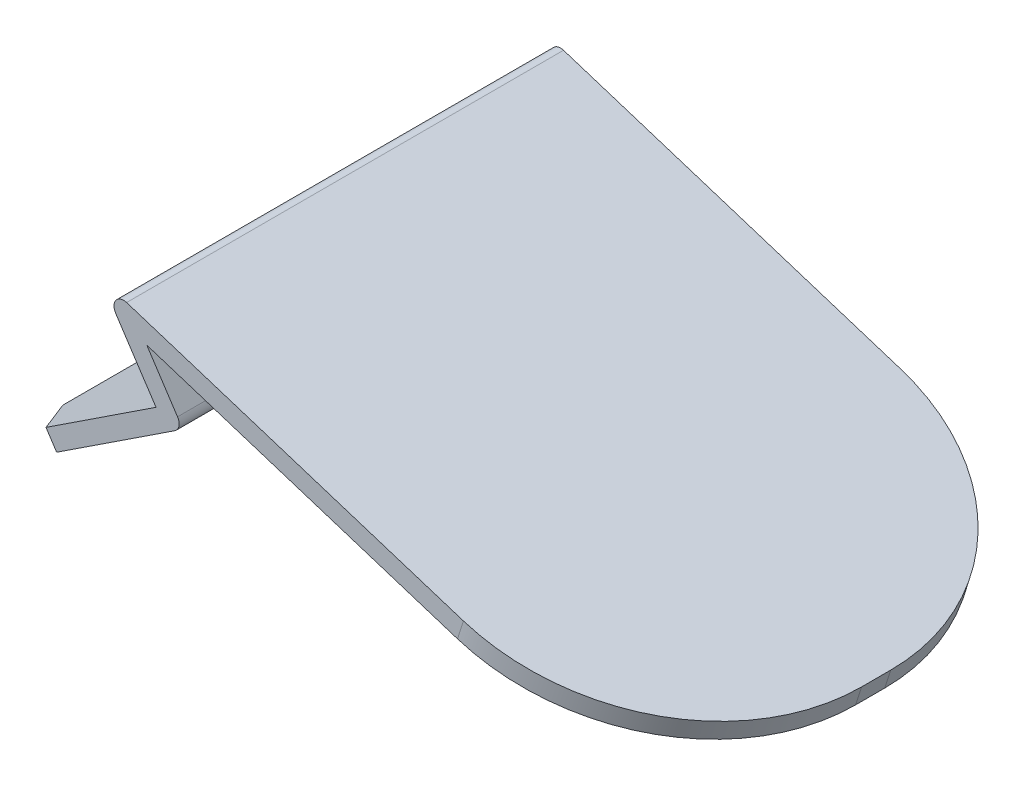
from build123d import *
from OCP.BRepFilletAPI import BRepFilletAPI_MakeChamfer

# Parameters (mm, degrees)
BOSS_EXTRUDE1_DEPTH = 45
FILLET1_R           = 1
CHAMFER1_SIZE       = 5
CHAMFER1_SIZE2      = 3.906428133
FILLET2_R           = 21


with BuildPart() as part:
    # Sketch1 → Boss-Extrude1 (new body)
    with BuildSketch(Plane.XY):
        Polygon((-33.133528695, -9.146199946), (-18.540520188, 0.452832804), (-24.258869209, 9.146199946), (33.133528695, -9.146199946), (32.526181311, -11.051752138), (-19.482919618, 5.524855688), (-15.770497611, -0.118984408), (-32.034426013, -10.817119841), align=None)
    extrude(amount=BOSS_EXTRUDE1_DEPTH)

    # Fillet1
    fillet1_edges = [part.edges().sort_by_distance(p)[0] for p in [
        (-24.258869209, 9.146199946, 22.5),
        (-15.770497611, -0.118984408, 22.5),
    ]]
    fillet(fillet1_edges, radius=FILLET1_R)

    # Chamfer1: one chamfer whose edges measure the first distance from different faces: ONE call of the kernel's chamfer builder (chamfer() names one face for all edges)
    chamfer1_edges_1 = [part.edges().sort_by_distance(p)[0] for p in [
        (-32.583977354, -9.981659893, 0),
    ]]
    chamfer1_side_1 = [part.faces().sort_by_distance(p)[0] for p in [
        (-20.046595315, 3.998841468, 0),
    ]]
    chamfer1_edges_2 = [part.edges().sort_by_distance(p)[0] for p in [
        (-32.583977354, -9.981659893, 45),
    ]]
    chamfer1_side_2 = [part.faces().sort_by_distance(p)[0] for p in [
        (-32.583977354, -9.981659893, 22.5),
    ]]
    chamfer1 = BRepFilletAPI_MakeChamfer(part.part.solid().wrapped)
    for e in chamfer1_edges_1:
        chamfer1.Add(CHAMFER1_SIZE, CHAMFER1_SIZE2, e.wrapped, chamfer1_side_1[0].wrapped)  # the first distance lies on this face
    for e in chamfer1_edges_2:
        chamfer1.Add(CHAMFER1_SIZE, CHAMFER1_SIZE2, e.wrapped, chamfer1_side_2[0].wrapped)  # the first distance lies on this face
    add(Compound.cast(chamfer1.Shape()), mode=Mode.REPLACE)

    # Fillet2
    fillet2_edges = [part.edges().sort_by_distance(p)[0] for p in [
        (32.829855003, -10.098976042, 45),
        (32.829855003, -10.098976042, 0),
    ]]
    fillet(fillet2_edges, radius=FILLET2_R)


solid = part.part
